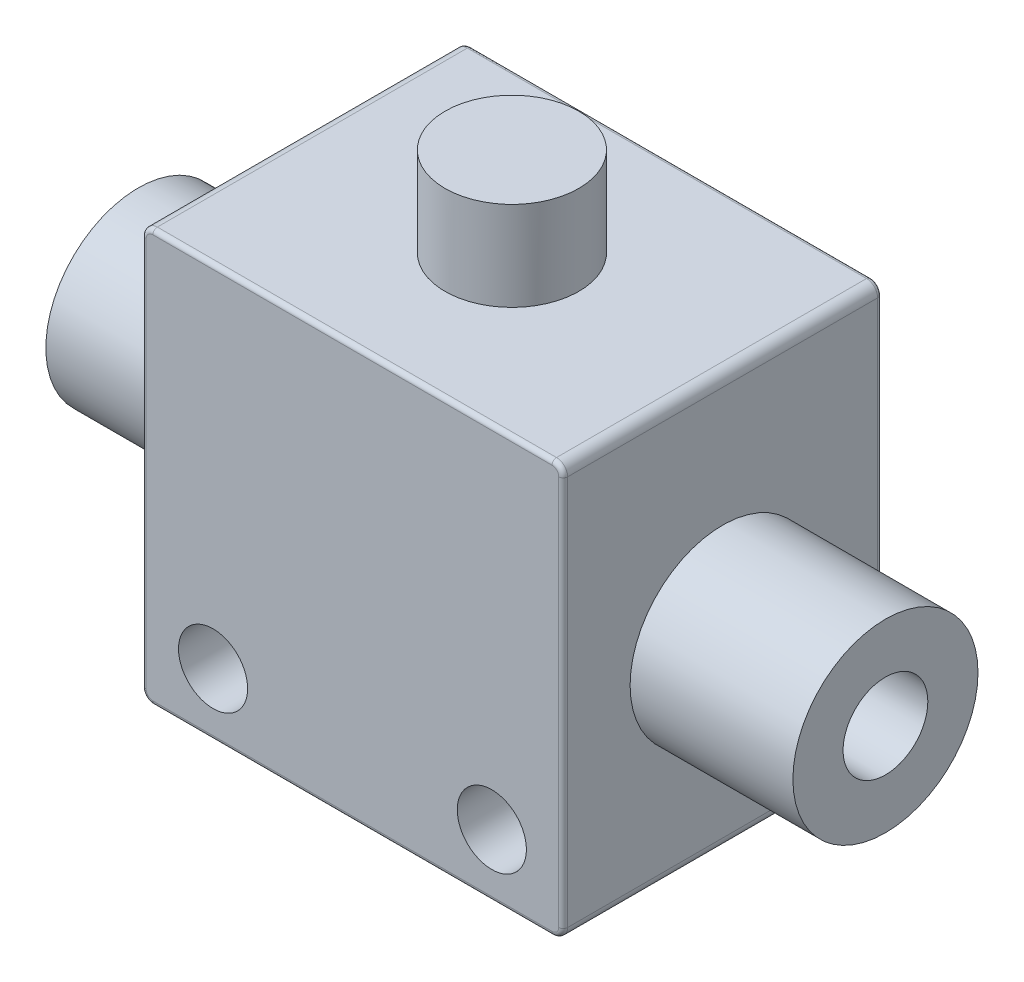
from build123d import *

# Parameters (mm, degrees)
SKETCH1_W          = 24.003
SKETCH1_H          = 18.161
EXTRUDE1_DEPTH     = 23.495
SKETCH2_R          = 5.2705
EXTRUDE2_DEPTH     = 9.271
SKETCH3_R          = 2.413
CUT_EXTRUDE1_DEPTH = 19.05
SKETCH4_R          = 1.9685
CUT_EXTRUDE2_DEPTH = 45.598161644
FILLET1_R          = 0.635
FILLET2_R          = 0.254
SKETCH5_R          = 3.81
EXTRUDE3_DEPTH     = 5.08


with BuildPart() as part:
    # Sketch1 → Extrude1 (new body)
    with BuildSketch(Plane(origin=(0, 0, 0), x_dir=(1, 0, 0), z_dir=(0, 1, 0))):
        with Locations((12.0015, 9.0805)):
            Rectangle(SKETCH1_W, SKETCH1_H)
    extrude(amount=EXTRUDE1_DEPTH)

    # Sketch2 → Extrude2 (add)
    with BuildSketch(Plane(origin=(24.003, 0, 0), x_dir=(0, 0, -1), z_dir=(1, 0, 0))):
        with Locations(Location((9.0805, 10.795, 0), (0, 0, 180))):
            Circle(SKETCH2_R)
    extrude2 = extrude(amount=EXTRUDE2_DEPTH)

    # Sketch3 → Cut-Extrude1 (cut)
    with BuildSketch(Plane(origin=(33.274, 0, 0), x_dir=(0, 0, -1), z_dir=(1, 0, 0))):
        with Locations((9.0805, 10.795)):
            Circle(SKETCH3_R)
    cut_extrude1 = extrude(amount=-CUT_EXTRUDE1_DEPTH, mode=Mode.SUBTRACT)

    # Sketch4 → Cut-Extrude2 (cut, through all)
    with BuildSketch(Plane.XY):
        with Locations((19.939, 3.556)):
            Circle(SKETCH4_R)
    cut_extrude2 = extrude(amount=-CUT_EXTRUDE2_DEPTH, mode=Mode.SUBTRACT)

    # Mirror1: Extrude2, Cut-Extrude1, Cut-Extrude2 across plane
    add(extrude2.mirror(Plane(origin=(12.0015, 0, 0), x_dir=(0, 0, 1), z_dir=(1, 0, 0))))
    add(cut_extrude1.mirror(Plane(origin=(12.0015, 0, 0), x_dir=(0, 0, 1), z_dir=(1, 0, 0))), mode=Mode.SUBTRACT)
    add(cut_extrude2.mirror(Plane(origin=(12.0015, 0, 0), x_dir=(0, 0, 1), z_dir=(1, 0, 0))), mode=Mode.SUBTRACT)

    # Fillet1
    fillet1_edges = [part.edges().sort_by_distance(p)[0] for p in [
        (24.003, 23.495, -9.0805),
        (0, 23.495, -9.0805),
        (24.003, 0, -9.0805),
        (0, 0, -9.0805),
    ]]
    fillet(fillet1_edges, radius=FILLET1_R)

    # Fillet2
    fillet2_edges = [part.edges().sort_by_distance(p)[0] for p in [
        (24.003, 11.7475, -18.161),
        (24.003, 11.7475, 0),
        (12.0015, 0, -18.161),
        (0, 11.7475, -18.161),
        (12.0015, 23.495, -18.161),
        (0.185987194, 23.309012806, -18.161),
        (0.185987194, 0.185987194, -18.161),
        (23.817012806, 23.309012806, -18.161),
        (23.817012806, 0.185987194, -18.161),
        (12.0015, 0, 0),
        (12.0015, 23.495, 0),
        (0, 11.7475, 0),
        (0.185987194, 23.309012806, 0),
        (0.185987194, 0.185987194, 0),
        (23.817012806, 23.309012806, 0),
        (23.817012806, 0.185987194, 0),
    ]]
    fillet(fillet2_edges, radius=FILLET2_R)

    # Sketch5 → Extrude3 (add)
    with BuildSketch(Plane(origin=(0, 23.495, 0), x_dir=(-1, 0, 0), z_dir=(0, 1, 0))):
        with Locations(Location((-12.0015, -9.0805, 0), (0, 0, 270))):
            Circle(SKETCH5_R)
    extrude(amount=EXTRUDE3_DEPTH)


solid = part.part
